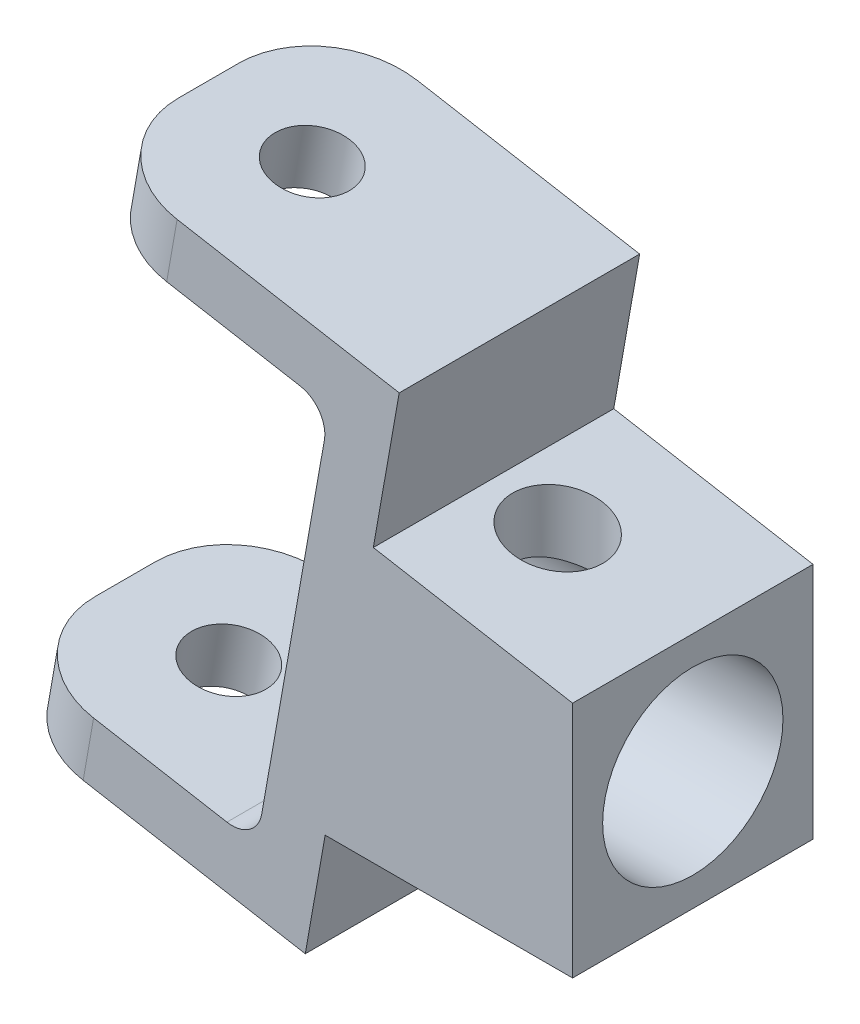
ISO-10303-21;
HEADER;
FILE_DESCRIPTION(('STEP AP214'),'2;1');
FILE_NAME('part.step','',(''),(''),'','','');
FILE_SCHEMA(('AUTOMOTIVE_DESIGN { 1 0 10303 214 1 1 1 1 }'));
ENDSEC;
DATA;
#1=APPLICATION_CONTEXT('core data for automotive mechanical design processes');
#2=APPLICATION_PROTOCOL_DEFINITION('international standard','automotive_design',2000,#1);
#3=PRODUCT_CONTEXT('',#1,'mechanical');
#4=PRODUCT('Part','Part','',(#3));
#5=PRODUCT_RELATED_PRODUCT_CATEGORY('part','',(#4));
#6=PRODUCT_DEFINITION_FORMATION('','',#4);
#7=PRODUCT_DEFINITION_CONTEXT('part definition',#1,'design');
#8=PRODUCT_DEFINITION('design','',#6,#7);
#9=PRODUCT_DEFINITION_SHAPE('','',#8);
#10=(LENGTH_UNIT() NAMED_UNIT(*) SI_UNIT(.MILLI.,.METRE.));
#11=(NAMED_UNIT(*) PLANE_ANGLE_UNIT() SI_UNIT($,.RADIAN.));
#12=(NAMED_UNIT(*) SI_UNIT($,.STERADIAN.) SOLID_ANGLE_UNIT());
#13=UNCERTAINTY_MEASURE_WITH_UNIT(LENGTH_MEASURE(1.E-05),#10,'distance_accuracy_value','');
#14=(GEOMETRIC_REPRESENTATION_CONTEXT(3) GLOBAL_UNCERTAINTY_ASSIGNED_CONTEXT((#13)) GLOBAL_UNIT_ASSIGNED_CONTEXT((#10,
#11,#12)) REPRESENTATION_CONTEXT('',''));
#15=CARTESIAN_POINT('',(0.,0.,0.));
#16=DIRECTION('',(0.,0.,1.));
#17=DIRECTION('',(1.,0.,0.));
#18=AXIS2_PLACEMENT_3D('',#15,#16,#17);
#19=CARTESIAN_POINT('',(-3.57647784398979,16.2849787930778,12.7));
#20=DIRECTION('',(-0.173648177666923,-0.984807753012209,0.));
#21=DIRECTION('',(0.98480775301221,-0.173648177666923,0.));
#22=AXIS2_PLACEMENT_3D('',#19,#20,#21);
#23=PLANE('',#22);
#24=DIRECTION('',(-0.984807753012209,0.173648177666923,0.));
#25=VECTOR('',#24,1.);
#26=CARTESIAN_POINT('',(-3.57647784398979,16.2849787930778,-12.7));
#27=LINE('',#26,#25);
#28=CARTESIAN_POINT('',(17.4752,12.573,-12.7));
#29=VERTEX_POINT('',#28);
#30=CARTESIAN_POINT('',(-3.57647784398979,16.2849787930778,-12.7));
#31=VERTEX_POINT('',#30);
#32=EDGE_CURVE('E228',#29,#31,#27,.T.);
#33=ORIENTED_EDGE('',*,*,#32,.T.);
#34=DIRECTION('',(0.,0.,-1.));
#35=VECTOR('',#34,1.);
#36=CARTESIAN_POINT('',(-3.57647784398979,16.2849787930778,12.7));
#37=LINE('',#36,#35);
#38=CARTESIAN_POINT('',(-3.57647784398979,16.2849787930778,12.7));
#39=VERTEX_POINT('',#38);
#40=EDGE_CURVE('E252',#39,#31,#37,.T.);
#41=ORIENTED_EDGE('',*,*,#40,.F.);
#42=DIRECTION('',(-0.984807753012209,0.173648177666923,0.));
#43=VECTOR('',#42,1.);
#44=CARTESIAN_POINT('',(-3.57647784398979,16.2849787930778,12.7));
#45=LINE('',#44,#43);
#46=CARTESIAN_POINT('',(17.4752,12.573,12.7));
#47=VERTEX_POINT('',#46);
#48=EDGE_CURVE('E206',#47,#39,#45,.T.);
#49=ORIENTED_EDGE('',*,*,#48,.F.);
#50=DIRECTION('',(0.,0.,-1.));
#51=VECTOR('',#50,1.);
#52=CARTESIAN_POINT('',(17.4752,12.573,12.7));
#53=LINE('',#52,#51);
#54=EDGE_CURVE('E255',#47,#29,#53,.T.);
#55=ORIENTED_EDGE('',*,*,#54,.T.);
#56=EDGE_LOOP('',(#33,#41,#49,#55));
#57=FACE_BOUND('',#56,.T.);
#58=CARTESIAN_POINT('',(3.2004,15.0900323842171,0.));
#59=DIRECTION('',(-0.173648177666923,-0.984807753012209,0.));
#60=DIRECTION('',(0.98480775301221,-0.173648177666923,0.));
#61=AXIS2_PLACEMENT_3D('',#58,#59,#60);
#62=ELLIPSE('',#61,4.83596923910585,4.7625);
#63=CARTESIAN_POINT('',(7.9629,14.2502751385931,0.));
#64=VERTEX_POINT('',#63);
#65=EDGE_CURVE('E328',#64,#64,#62,.F.);
#66=ORIENTED_EDGE('',*,*,#65,.F.);
#67=EDGE_LOOP('',(#66));
#68=FACE_BOUND('',#67,.T.);
#69=ADVANCED_FACE('F47',(#57,#68),#23,.F.);
#70=CARTESIAN_POINT('',(-23.495,0.,0.));
#71=DIRECTION('',(1.,0.,0.));
#72=DIRECTION('',(0.,0.,-1.));
#73=AXIS2_PLACEMENT_3D('',#70,#71,#72);
#74=CYLINDRICAL_SURFACE('',#73,9.525);
#75=CARTESIAN_POINT('',(3.2004,-8.98025612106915,3.175));
#76=CARTESIAN_POINT('',(3.02746354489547,-8.98025555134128,3.17500081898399));
#77=CARTESIAN_POINT('',(2.85453201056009,-8.98530617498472,3.16082293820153));
#78=CARTESIAN_POINT('',(2.51379221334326,-9.00485797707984,3.10467734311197));
#79=CARTESIAN_POINT('',(2.34598479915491,-9.01936071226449,3.06270505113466));
#80=CARTESIAN_POINT('',(2.02048461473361,-9.05599546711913,2.95260866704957));
#81=CARTESIAN_POINT('',(1.86277272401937,-9.07811252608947,2.8845358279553));
#82=CARTESIAN_POINT('',(1.56095684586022,-9.12746212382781,2.72434567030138));
#83=CARTESIAN_POINT('',(1.41685587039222,-9.15469579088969,2.63222304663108));
#84=CARTESIAN_POINT('',(1.14071411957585,-9.21240503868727,2.42268738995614));
#85=CARTESIAN_POINT('',(1.00928351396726,-9.24296141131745,2.30449228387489));
#86=CARTESIAN_POINT('',(0.76769340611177,-9.30319020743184,2.0478358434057));
#87=CARTESIAN_POINT('',(0.657537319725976,-9.33286248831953,1.90937126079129));
#88=CARTESIAN_POINT('',(0.458854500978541,-9.38891527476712,1.61164431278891));
#89=CARTESIAN_POINT('',(0.370967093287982,-9.41518969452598,1.45193356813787));
#90=CARTESIAN_POINT('',(0.223546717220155,-9.46053437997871,1.11896913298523));
#91=CARTESIAN_POINT('',(0.164006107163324,-9.47960658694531,0.945719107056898));
#92=CARTESIAN_POINT('',(0.0770386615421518,-9.50782564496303,0.596991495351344));
#93=CARTESIAN_POINT('',(0.0485665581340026,-9.5172947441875,0.421801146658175));
#94=CARTESIAN_POINT('',(0.0212207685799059,-9.52638456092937,0.0688907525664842));
#95=CARTESIAN_POINT('',(0.02233945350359,-9.52600781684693,-0.108828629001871));
#96=CARTESIAN_POINT('',(0.0534805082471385,-9.51566675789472,-0.454353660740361));
#97=CARTESIAN_POINT('',(0.0823675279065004,-9.50607905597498,-0.622274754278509));
#98=CARTESIAN_POINT('',(0.166347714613,-9.47886621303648,-0.950732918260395));
#99=CARTESIAN_POINT('',(0.221442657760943,-9.46124052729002,-1.11126948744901));
#100=CARTESIAN_POINT('',(0.356937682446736,-9.41945253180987,-1.42288410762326));
#101=CARTESIAN_POINT('',(0.437660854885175,-9.3952073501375,-1.57381010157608));
#102=CARTESIAN_POINT('',(0.621854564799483,-9.34270397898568,-1.86030973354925));
#103=CARTESIAN_POINT('',(0.725331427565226,-9.31444467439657,-1.99587908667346));
#104=CARTESIAN_POINT('',(0.957816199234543,-9.25532159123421,-2.2545702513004));
#105=CARTESIAN_POINT('',(1.0877967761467,-9.22439783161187,-2.37680549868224));
#106=CARTESIAN_POINT('',(1.36667470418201,-9.1645528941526,-2.5980302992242));
#107=CARTESIAN_POINT('',(1.51557496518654,-9.13563202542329,-2.6970162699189));
#108=CARTESIAN_POINT('',(1.83087526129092,-9.08273917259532,-2.87016016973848));
#109=CARTESIAN_POINT('',(1.99749451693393,-9.05884361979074,-2.94394402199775));
#110=CARTESIAN_POINT('',(2.34178917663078,-9.01959241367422,-3.06210713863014));
#111=CARTESIAN_POINT('',(2.51945991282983,-9.00423318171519,-3.10649872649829));
#112=CARTESIAN_POINT('',(2.87222677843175,-8.98460345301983,-3.16281207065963));
#113=CARTESIAN_POINT('',(3.04707742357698,-8.9798639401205,-3.17610837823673));
#114=CARTESIAN_POINT('',(3.39653927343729,-8.9806993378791,-3.17374726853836));
#115=CARTESIAN_POINT('',(3.57115051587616,-8.98627237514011,-3.15809511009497));
#116=CARTESIAN_POINT('',(3.90892336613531,-9.00663737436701,-3.09951644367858));
#117=CARTESIAN_POINT('',(4.07227224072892,-9.02110608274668,-3.05754530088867));
#118=CARTESIAN_POINT('',(4.38957594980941,-9.05727657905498,-2.94866651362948));
#119=CARTESIAN_POINT('',(4.54352911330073,-9.07897964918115,-2.88175444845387));
#120=CARTESIAN_POINT('',(4.84308283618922,-9.12802586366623,-2.72248103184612));
#121=CARTESIAN_POINT('',(4.98826359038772,-9.1555260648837,-2.62937980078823));
#122=CARTESIAN_POINT('',(5.26143871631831,-9.21276315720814,-2.42120937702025));
#123=CARTESIAN_POINT('',(5.38942800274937,-9.24250070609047,-2.30613370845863));
#124=CARTESIAN_POINT('',(5.63095134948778,-9.30259247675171,-2.05070616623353));
#125=CARTESIAN_POINT('',(5.74349368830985,-9.33290753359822,-1.90940458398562));
#126=CARTESIAN_POINT('',(5.94333375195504,-9.3893275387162,-1.60917665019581));
#127=CARTESIAN_POINT('',(6.0306323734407,-9.41543263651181,-1.45025092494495));
#128=CARTESIAN_POINT('',(6.17670883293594,-9.46036988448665,-1.12007606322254));
#129=CARTESIAN_POINT('',(6.23567230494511,-9.47924920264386,-0.948915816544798));
#130=CARTESIAN_POINT('',(6.32373558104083,-9.50781089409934,-0.598355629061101));
#131=CARTESIAN_POINT('',(6.35284616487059,-9.51749658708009,-0.418958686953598));
#132=CARTESIAN_POINT('',(6.37940709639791,-9.52632915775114,-0.0660886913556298));
#133=CARTESIAN_POINT('',(6.3782811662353,-9.52594996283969,0.107266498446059));
#134=CARTESIAN_POINT('',(6.34791304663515,-9.51586223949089,0.451202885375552));
#135=CARTESIAN_POINT('',(6.31867313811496,-9.50615446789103,0.621784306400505));
#136=CARTESIAN_POINT('',(6.23385140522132,-9.47867404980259,0.952633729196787));
#137=CARTESIAN_POINT('',(6.17869536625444,-9.46103195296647,1.11302251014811));
#138=CARTESIAN_POINT('',(6.04400133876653,-9.41949985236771,1.42233126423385));
#139=CARTESIAN_POINT('',(5.96445893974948,-9.39560871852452,1.57124915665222));
#140=CARTESIAN_POINT('',(5.77986679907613,-9.34294133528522,1.85938800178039));
#141=CARTESIAN_POINT('',(5.67398317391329,-9.31401720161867,1.9980473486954));
#142=CARTESIAN_POINT('',(5.44113278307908,-9.25490239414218,2.25609475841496));
#143=CARTESIAN_POINT('',(5.31415929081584,-9.22471131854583,2.37547664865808));
#144=CARTESIAN_POINT('',(5.03679029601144,-9.16505913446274,2.59633024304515));
#145=CARTESIAN_POINT('',(4.88567250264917,-9.13567286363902,2.69691791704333));
#146=CARTESIAN_POINT('',(4.56776319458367,-9.08241113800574,2.87119803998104));
#147=CARTESIAN_POINT('',(4.40097578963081,-9.05853424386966,2.94489751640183));
#148=CARTESIAN_POINT('',(4.06412120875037,-9.02021736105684,3.06020415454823));
#149=CARTESIAN_POINT('',(3.89454306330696,-9.00539959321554,3.10311136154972));
#150=CARTESIAN_POINT('',(3.55010703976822,-8.9854209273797,3.16050396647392));
#151=CARTESIAN_POINT('',(3.375251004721,-8.98025669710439,3.17499917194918));
#152=CARTESIAN_POINT('',(3.2004,-8.98025612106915,3.175));
#153=B_SPLINE_CURVE_WITH_KNOTS('',3,(#75,#76,#77,#78,#79,#80,#81,#82,#83,#84,#85,#86,#87,#88,
#89,#90,#91,#92,#93,#94,#95,#96,#97,#98,#99,#100,#101,#102,#103,#104,#105,#106,#107,#108,#109,
#110,#111,#112,#113,#114,#115,#116,#117,#118,#119,#120,#121,#122,#123,#124,#125,#126,#127,#128,
#129,#130,#131,#132,#133,#134,#135,#136,#137,#138,#139,#140,#141,#142,#143,#144,#145,#146,#147,
#148,#149,#150,#151,#152),.UNSPECIFIED.,.T.,.F.,(4,2,2,2,2,2,2,2,2,2,2,2,2,2,2,2,2,2,2,2,2,2,2,
2,2,2,2,2,2,2,2,2,2,2,2,2,2,2,4),(0.,0.518161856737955,1.03640907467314,1.55364379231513,
2.07099270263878,2.60671746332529,3.14252816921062,3.69231882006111,4.24196117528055,
4.77247962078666,5.30286129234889,5.81244090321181,6.32205505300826,6.83836754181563,
7.3548237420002,7.89559553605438,8.43645060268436,8.98501631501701,9.53335188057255,
10.056948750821,10.5804505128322,11.0859695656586,11.5915782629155,12.1132237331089,
12.6350231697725,13.1819271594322,13.7288117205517,14.2720628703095,14.815117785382,
15.3326491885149,15.8501386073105,16.3594083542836,16.8687702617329,17.3969527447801,
17.925304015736,18.4743376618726,19.023227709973,19.5473069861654,20.0712053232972),.UNSPECIFIED.);
#154=CARTESIAN_POINT('',(3.2004,-8.98025612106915,3.175));
#155=VERTEX_POINT('',#154);
#156=EDGE_CURVE('E329',#155,#155,#153,.T.);
#157=ORIENTED_EDGE('',*,*,#156,.T.);
#158=EDGE_LOOP('',(#157));
#159=FACE_BOUND('',#158,.T.);
#160=CARTESIAN_POINT('',(17.4752,0.,0.));
#161=DIRECTION('',(-1.,0.,0.));
#162=DIRECTION('',(0.,0.,1.));
#163=AXIS2_PLACEMENT_3D('',#160,#161,#162);
#164=CIRCLE('',#163,9.525);
#165=CARTESIAN_POINT('',(17.4752,0.,9.525));
#166=VERTEX_POINT('',#165);
#167=EDGE_CURVE('E222',#166,#166,#164,.T.);
#168=ORIENTED_EDGE('',*,*,#167,.F.);
#169=EDGE_LOOP('',(#168));
#170=FACE_BOUND('',#169,.T.);
#171=CARTESIAN_POINT('',(-12.8959179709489,0.,0.));
#172=DIRECTION('',(0.984807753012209,-0.173648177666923,0.));
#173=DIRECTION('',(0.173648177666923,0.984807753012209,0.));
#174=AXIS2_PLACEMENT_3D('',#171,#172,#173);
#175=ELLIPSE('',#174,9.67193847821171,9.525);
#176=CARTESIAN_POINT('',(-11.2164034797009,9.525,0.));
#177=VERTEX_POINT('',#176);
#178=EDGE_CURVE('E265',#177,#177,#175,.T.);
#179=ORIENTED_EDGE('',*,*,#178,.F.);
#180=EDGE_LOOP('',(#179));
#181=FACE_BOUND('',#180,.T.);
#182=CARTESIAN_POINT('',(3.2004,8.24889197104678,-4.7625));
#183=CARTESIAN_POINT('',(3.32454090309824,8.24889272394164,-4.76249940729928));
#184=CARTESIAN_POINT('',(3.44869285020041,8.25170408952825,-4.75763943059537));
#185=CARTESIAN_POINT('',(3.69603834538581,8.26284430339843,-4.73826449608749));
#186=CARTESIAN_POINT('',(3.8192314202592,8.27117572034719,-4.72374504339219));
#187=CARTESIAN_POINT('',(4.06385414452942,8.29306424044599,-4.68521103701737));
#188=CARTESIAN_POINT('',(4.18528071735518,8.30662953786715,-4.66118159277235));
#189=CARTESIAN_POINT('',(4.42533163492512,8.33849424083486,-4.60393332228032));
#190=CARTESIAN_POINT('',(4.54395473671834,8.35679570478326,-4.57071050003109));
#191=CARTESIAN_POINT('',(4.89309842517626,8.41767757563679,-4.45820926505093));
#192=CARTESIAN_POINT('',(5.11848003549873,8.46639036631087,-4.36584227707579));
#193=CARTESIAN_POINT('',(5.55037176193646,8.57453511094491,-4.14940045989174));
#194=CARTESIAN_POINT('',(5.75688085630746,8.63396764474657,-4.02532391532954));
#195=CARTESIAN_POINT('',(6.16411386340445,8.76284791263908,-3.73698658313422));
#196=CARTESIAN_POINT('',(6.36295582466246,8.83271738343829,-3.57025552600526));
#197=CARTESIAN_POINT('',(6.73138327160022,8.97122433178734,-3.20633353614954));
#198=CARTESIAN_POINT('',(6.9009541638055,9.03986117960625,-3.00912750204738));
#199=CARTESIAN_POINT('',(7.1353931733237,9.13908932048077,-2.68636629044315));
#200=CARTESIAN_POINT('',(7.21224727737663,9.17251360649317,-2.57020878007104));
#201=CARTESIAN_POINT('',(7.35580380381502,9.23620349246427,-2.33097830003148));
#202=CARTESIAN_POINT('',(7.42251026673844,9.26647034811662,-2.20790810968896));
#203=CARTESIAN_POINT('',(7.54511086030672,9.32297018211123,-1.95564815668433));
#204=CARTESIAN_POINT('',(7.60100777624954,9.34920419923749,-1.8264599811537));
#205=CARTESIAN_POINT('',(7.70137304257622,9.39686248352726,-1.56285911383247));
#206=CARTESIAN_POINT('',(7.7458426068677,9.41828726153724,-1.42844697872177));
#207=CARTESIAN_POINT('',(7.82003977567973,9.45432792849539,-1.16519740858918));
#208=CARTESIAN_POINT('',(7.85059082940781,9.46931966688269,-1.03664325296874));
#209=CARTESIAN_POINT('',(7.90095552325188,9.49415396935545,-0.776963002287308));
#210=CARTESIAN_POINT('',(7.9207702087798,9.50399703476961,-0.645837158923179));
#211=CARTESIAN_POINT('',(7.94939346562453,9.51824582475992,-0.382159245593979));
#212=CARTESIAN_POINT('',(7.95820734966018,9.52265417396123,-0.249607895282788));
#213=CARTESIAN_POINT('',(7.9647234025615,9.52591136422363,0.0158324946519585));
#214=CARTESIAN_POINT('',(7.96242625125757,9.52476054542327,0.148721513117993));
#215=CARTESIAN_POINT('',(7.94744035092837,9.51727773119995,0.402105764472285));
#216=CARTESIAN_POINT('',(7.93567586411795,9.51140660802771,0.522670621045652));
#217=CARTESIAN_POINT('',(7.90305197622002,9.49520689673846,0.762297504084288));
#218=CARTESIAN_POINT('',(7.88218970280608,9.48487690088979,0.881359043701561));
#219=CARTESIAN_POINT('',(7.8316014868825,9.4600084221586,1.11709538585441));
#220=CARTESIAN_POINT('',(7.80187851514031,9.44547134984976,1.23377097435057));
#221=CARTESIAN_POINT('',(7.73387365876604,9.41253030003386,1.46405663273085));
#222=CARTESIAN_POINT('',(7.69558848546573,9.39412483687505,1.57766550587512));
#223=CARTESIAN_POINT('',(7.5672557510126,9.33315909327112,1.91586173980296));
#224=CARTESIAN_POINT('',(7.46439106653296,9.28518547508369,2.13476891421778));
#225=CARTESIAN_POINT('',(7.22820846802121,9.1791264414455,2.55262754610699));
#226=CARTESIAN_POINT('',(7.09487965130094,9.12103740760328,2.75157182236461));
#227=CARTESIAN_POINT('',(6.7870735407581,8.99371794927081,3.14406030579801));
#228=CARTESIAN_POINT('',(6.60989793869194,8.92395340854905,3.33531640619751));
#229=CARTESIAN_POINT('',(6.22650279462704,8.78462733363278,3.68669670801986));
#230=CARTESIAN_POINT('',(6.02026111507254,8.71506599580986,3.84679695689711));
#231=CARTESIAN_POINT('',(5.68528647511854,8.61432292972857,4.06522723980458));
#232=CARTESIAN_POINT('',(5.56540552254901,8.58040455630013,4.13613898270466));
#233=CARTESIAN_POINT('',(5.31921939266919,8.51583950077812,4.2674875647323));
#234=CARTESIAN_POINT('',(5.19291713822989,8.48519134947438,4.32792911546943));
#235=CARTESIAN_POINT('',(4.93467749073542,8.42829064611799,4.43772127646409));
#236=CARTESIAN_POINT('',(4.80274209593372,8.40203655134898,4.48707578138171));
#237=CARTESIAN_POINT('',(4.53419461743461,8.35498507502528,4.57409004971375));
#238=CARTESIAN_POINT('',(4.39758547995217,8.33418432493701,4.61175703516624));
#239=CARTESIAN_POINT('',(4.13167489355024,8.30033105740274,4.67239107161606));
#240=CARTESIAN_POINT('',(4.00264530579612,8.28679731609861,4.69628224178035));
#241=CARTESIAN_POINT('',(3.74263279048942,8.26567972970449,4.73335209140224));
#242=CARTESIAN_POINT('',(3.61165091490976,8.25809279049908,4.74653634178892));
#243=CARTESIAN_POINT('',(3.3488800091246,8.24918359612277,4.76200330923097));
#244=CARTESIAN_POINT('',(3.21709129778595,8.24785900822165,4.76429008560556));
#245=CARTESIAN_POINT('',(2.95387308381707,8.25152581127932,4.75793657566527));
#246=CARTESIAN_POINT('',(2.82244355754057,8.25651677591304,4.74929702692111));
#247=CARTESIAN_POINT('',(2.57547646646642,8.27171481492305,4.72277057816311));
#248=CARTESIAN_POINT('',(2.45977794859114,8.28128924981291,4.70600273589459));
#249=CARTESIAN_POINT('',(2.23035796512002,8.30494741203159,4.66412284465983));
#250=CARTESIAN_POINT('',(2.1166371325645,8.3190325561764,4.63900817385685));
#251=CARTESIAN_POINT('',(1.77954618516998,8.36742301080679,4.55152408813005));
#252=CARTESIAN_POINT('',(1.5600861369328,8.40787423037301,4.47699683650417));
#253=CARTESIAN_POINT('',(1.12671869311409,8.50278882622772,4.29409140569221));
#254=CARTESIAN_POINT('',(0.913539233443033,8.55781440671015,4.18430528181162));
#255=CARTESIAN_POINT('',(0.507360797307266,8.67518529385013,3.93519108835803));
#256=CARTESIAN_POINT('',(0.314372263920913,8.73753435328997,3.79584784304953));
#257=CARTESIAN_POINT('',(-0.0713340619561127,8.87196405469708,3.4710976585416));
#258=CARTESIAN_POINT('',(-0.260951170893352,8.94428069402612,3.28209830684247));
#259=CARTESIAN_POINT('',(-0.60682104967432,9.08372577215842,2.87366994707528));
#260=CARTESIAN_POINT('',(-0.763062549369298,9.15085245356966,2.65423070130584));
#261=CARTESIAN_POINT('',(-0.970606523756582,9.24324496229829,2.30289806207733));
#262=CARTESIAN_POINT('',(-1.03599815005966,9.27299632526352,2.18030840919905));
#263=CARTESIAN_POINT('',(-1.15610308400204,9.32847745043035,1.9291530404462));
#264=CARTESIAN_POINT('',(-1.21082112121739,9.35420899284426,1.80059000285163));
#265=CARTESIAN_POINT('',(-1.30894255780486,9.40087915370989,1.53844708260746));
#266=CARTESIAN_POINT('',(-1.35235135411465,9.42182005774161,1.40486962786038));
#267=CARTESIAN_POINT('',(-1.42732989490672,9.45827821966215,1.13371049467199));
#268=CARTESIAN_POINT('',(-1.4589010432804,9.47379612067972,0.996129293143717));
#269=CARTESIAN_POINT('',(-1.50742176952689,9.49775785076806,0.730949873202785));
#270=CARTESIAN_POINT('',(-1.52544742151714,9.50672024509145,0.603594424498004));
#271=CARTESIAN_POINT('',(-1.55114001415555,9.51951815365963,0.34759030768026));
#272=CARTESIAN_POINT('',(-1.55880775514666,9.52335406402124,0.218941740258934));
#273=CARTESIAN_POINT('',(-1.56368417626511,9.52579195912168,-0.0385649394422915));
#274=CARTESIAN_POINT('',(-1.56089590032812,9.52439546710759,-0.167422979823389));
#275=CARTESIAN_POINT('',(-1.54490494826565,9.51641162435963,-0.424324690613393));
#276=CARTESIAN_POINT('',(-1.5317025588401,9.50982441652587,-0.552368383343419));
#277=CARTESIAN_POINT('',(-1.49626541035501,9.4922422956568,-0.798199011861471));
#278=CARTESIAN_POINT('',(-1.47468637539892,9.48156800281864,-0.916103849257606));
#279=CARTESIAN_POINT('',(-1.42283196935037,9.45610870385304,-1.14954398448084));
#280=CARTESIAN_POINT('',(-1.39255382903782,9.44132238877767,-1.26507851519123));
#281=CARTESIAN_POINT('',(-1.28910564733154,9.39128133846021,-1.60695881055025));
#282=CARTESIAN_POINT('',(-1.20329141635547,9.35032881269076,-1.82878870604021));
#283=CARTESIAN_POINT('',(-0.996655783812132,9.25477034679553,-2.26424000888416));
#284=CARTESIAN_POINT('',(-0.874494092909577,9.1996553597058,-2.47710454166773));
#285=CARTESIAN_POINT('',(-0.600274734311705,9.08152237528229,-2.88023067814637));
#286=CARTESIAN_POINT('',(-0.448203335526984,9.01850075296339,-3.07048183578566));
#287=CARTESIAN_POINT('',(-0.100988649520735,8.88342722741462,-3.44287591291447));
#288=CARTESIAN_POINT('',(0.0969350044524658,8.81110081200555,-3.62232759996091));
#289=CARTESIAN_POINT('',(0.52130043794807,8.67074486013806,-3.94652779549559));
#290=CARTESIAN_POINT('',(0.747767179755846,8.60271916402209,-4.09124560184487));
#291=CARTESIAN_POINT('',(1.10891923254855,8.50907579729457,-4.28094082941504));
#292=CARTESIAN_POINT('',(1.23503657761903,8.47885685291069,-4.34031088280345));
#293=CARTESIAN_POINT('',(1.49281082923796,8.42284293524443,-4.44803619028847));
#294=CARTESIAN_POINT('',(1.62446484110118,8.39704568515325,-4.49639711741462));
#295=CARTESIAN_POINT('',(1.89205350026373,8.35096779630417,-4.58140792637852));
#296=CARTESIAN_POINT('',(2.02797612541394,8.33067298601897,-4.61808793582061));
#297=CARTESIAN_POINT('',(2.3032327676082,8.29641582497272,-4.67935352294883));
#298=CARTESIAN_POINT('',(2.44256432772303,8.28244904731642,-4.70394755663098));
#299=CARTESIAN_POINT('',(2.6850954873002,8.26434282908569,-4.73566148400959));
#300=CARTESIAN_POINT('',(2.78780006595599,8.25856285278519,-4.74571628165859));
#301=CARTESIAN_POINT('',(2.99380052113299,8.25083698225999,-4.7591360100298));
#302=CARTESIAN_POINT('',(3.09709643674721,8.24889134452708,-4.76250049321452));
#303=CARTESIAN_POINT('',(3.2004,8.24889197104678,-4.7625));
#304=B_SPLINE_CURVE_WITH_KNOTS('',3,(#182,#183,#184,#185,#186,#187,#188,#189,#190,#191,#192,
#193,#194,#195,#196,#197,#198,#199,#200,#201,#202,#203,#204,#205,#206,#207,#208,#209,#210,#211,
#212,#213,#214,#215,#216,#217,#218,#219,#220,#221,#222,#223,#224,#225,#226,#227,#228,#229,#230,
#231,#232,#233,#234,#235,#236,#237,#238,#239,#240,#241,#242,#243,#244,#245,#246,#247,#248,#249,
#250,#251,#252,#253,#254,#255,#256,#257,#258,#259,#260,#261,#262,#263,#264,#265,#266,#267,#268,
#269,#270,#271,#272,#273,#274,#275,#276,#277,#278,#279,#280,#281,#282,#283,#284,#285,#286,#287,
#288,#289,#290,#291,#292,#293,#294,#295,#296,#297,#298,#299,#300,#301,#302,#303),.UNSPECIFIED.,
.T.,.F.,(4,2,2,2,2,2,2,2,2,2,2,2,2,2,2,2,2,2,2,2,2,2,2,2,2,2,2,2,2,2,2,2,2,2,2,2,2,2,2,2,2,2,2,
2,2,2,2,2,2,2,2,2,2,2,2,2,2,2,2,2,4),(0.,0.372315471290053,0.744804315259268,1.11787871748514,
1.49111553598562,2.23280682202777,2.97453823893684,3.77744614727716,4.58075320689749,
5.00998800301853,5.43905143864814,5.8680041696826,6.29691131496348,6.69531812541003,
7.09368613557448,7.4918616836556,7.89001286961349,8.25342137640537,8.61694470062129,
8.98034628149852,9.3438876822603,10.0802760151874,10.8169283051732,11.6232144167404,
12.4301179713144,12.8597106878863,13.2891095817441,13.7183573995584,14.1473394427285,
14.5425345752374,14.9375239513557,15.3323661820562,15.7271817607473,16.0786628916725,
16.4302545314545,17.1329551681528,17.8682015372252,18.603826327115,19.432180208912,
20.2608133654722,20.6865967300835,21.1121909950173,21.5375817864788,21.9629221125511,
22.3492223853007,22.735492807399,23.1216507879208,23.5077981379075,23.8683853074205,
24.2290873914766,24.9498683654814,25.7014774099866,26.4534323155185,27.2802219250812,
28.1077396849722,28.5351353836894,28.9623103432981,29.388374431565,29.8141399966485,
30.1239407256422,30.4337621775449),.UNSPECIFIED.);
#305=CARTESIAN_POINT('',(3.2004,8.24889197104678,-4.7625));
#306=VERTEX_POINT('',#305);
#307=EDGE_CURVE('E322',#306,#306,#304,.T.);
#308=ORIENTED_EDGE('',*,*,#307,.F.);
#309=EDGE_LOOP('',(#308));
#310=FACE_BOUND('',#309,.T.);
#311=ADVANCED_FACE('F330',(#159,#170,#181,#310),#74,.F.);
#312=CARTESIAN_POINT('',(-42.5048376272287,-12.4325729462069,12.7));
#313=DIRECTION('',(0.984807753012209,-0.173648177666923,0.));
#314=DIRECTION('',(0.173648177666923,0.984807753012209,0.));
#315=AXIS2_PLACEMENT_3D('',#312,#313,#314);
#316=PLANE('',#315);
#317=DIRECTION('',(0.,0.,-1.));
#318=VECTOR('',#317,1.);
#319=CARTESIAN_POINT('',(-43.6075035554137,-18.6861021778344,12.7));
#320=LINE('',#319,#318);
#321=CARTESIAN_POINT('',(-43.6075035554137,-18.6861021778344,3.175));
#322=VERTEX_POINT('',#321);
#323=CARTESIAN_POINT('',(-43.6075035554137,-18.6861021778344,-3.175));
#324=VERTEX_POINT('',#323);
#325=EDGE_CURVE('E193',#322,#324,#320,.T.);
#326=ORIENTED_EDGE('',*,*,#325,.F.);
#327=DIRECTION('',(-0.173648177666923,-0.984807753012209,0.));
#328=VECTOR('',#327,1.);
#329=CARTESIAN_POINT('',(-42.5048376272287,-12.4325729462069,3.175));
#330=LINE('',#329,#328);
#331=CARTESIAN_POINT('',(-42.5048376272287,-12.4325729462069,3.175));
#332=VERTEX_POINT('',#331);
#333=EDGE_CURVE('E284',#322,#332,#330,.F.);
#334=ORIENTED_EDGE('',*,*,#333,.T.);
#335=DIRECTION('',(0.,0.,-1.));
#336=VECTOR('',#335,1.);
#337=CARTESIAN_POINT('',(-42.5048376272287,-12.4325729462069,12.7));
#338=LINE('',#337,#336);
#339=CARTESIAN_POINT('',(-42.5048376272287,-12.4325729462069,-3.175));
#340=VERTEX_POINT('',#339);
#341=EDGE_CURVE('E219',#332,#340,#338,.T.);
#342=ORIENTED_EDGE('',*,*,#341,.T.);
#343=DIRECTION('',(-0.173648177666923,-0.984807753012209,0.));
#344=VECTOR('',#343,1.);
#345=CARTESIAN_POINT('',(-42.5048376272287,-12.4325729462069,-3.175));
#346=LINE('',#345,#344);
#347=EDGE_CURVE('E281',#340,#324,#346,.T.);
#348=ORIENTED_EDGE('',*,*,#347,.T.);
#349=EDGE_LOOP('',(#326,#334,#342,#348));
#350=FACE_BOUND('',#349,.T.);
#351=ADVANCED_FACE('F361',(#350),#316,.F.);
#352=CARTESIAN_POINT('',(-43.6075035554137,-18.6861021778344,12.7));
#353=DIRECTION('',(0.173648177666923,0.984807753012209,0.));
#354=DIRECTION('',(-0.98480775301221,0.173648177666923,0.));
#355=AXIS2_PLACEMENT_3D('',#352,#353,#354);
#356=PLANE('',#355);
#357=CARTESIAN_POINT('',(-32.6513203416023,-20.6179728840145,0.));
#358=DIRECTION('',(0.173648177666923,0.984807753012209,0.));
#359=DIRECTION('',(-0.98480775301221,0.173648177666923,0.));
#360=AXIS2_PLACEMENT_3D('',#357,#358,#359);
#361=CIRCLE('',#360,3.9878);
#362=CARTESIAN_POINT('',(-36.5785366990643,-19.9254986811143,0.));
#363=VERTEX_POINT('',#362);
#364=EDGE_CURVE('E268',#363,#363,#361,.T.);
#365=ORIENTED_EDGE('',*,*,#364,.T.);
#366=EDGE_LOOP('',(#365));
#367=FACE_BOUND('',#366,.T.);
#368=DIRECTION('',(0.984807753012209,-0.173648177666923,0.));
#369=VECTOR('',#368,1.);
#370=CARTESIAN_POINT('',(-43.6075035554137,-18.6861021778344,12.7));
#371=LINE('',#370,#369);
#372=CARTESIAN_POINT('',(-34.2272097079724,-20.3401010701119,12.7));
#373=VERTEX_POINT('',#372);
#374=CARTESIAN_POINT('',(-10.7639680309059,-24.4773036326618,12.7));
#375=VERTEX_POINT('',#374);
#376=EDGE_CURVE('E174',#373,#375,#371,.T.);
#377=ORIENTED_EDGE('',*,*,#376,.F.);
#378=CARTESIAN_POINT('',(-34.2272097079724,-20.3401010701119,3.175));
#379=DIRECTION('',(0.173648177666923,0.984807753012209,0.));
#380=DIRECTION('',(-0.98480775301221,0.173648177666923,0.));
#381=AXIS2_PLACEMENT_3D('',#378,#379,#380);
#382=CIRCLE('',#381,9.525);
#383=EDGE_CURVE('E279',#373,#322,#382,.F.);
#384=ORIENTED_EDGE('',*,*,#383,.T.);
#385=ORIENTED_EDGE('',*,*,#325,.T.);
#386=CARTESIAN_POINT('',(-34.2272097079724,-20.3401010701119,-3.175));
#387=DIRECTION('',(0.173648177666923,0.984807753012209,0.));
#388=DIRECTION('',(-0.98480775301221,0.173648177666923,0.));
#389=AXIS2_PLACEMENT_3D('',#386,#387,#388);
#390=CIRCLE('',#389,9.525);
#391=CARTESIAN_POINT('',(-34.2272097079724,-20.3401010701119,-12.7));
#392=VERTEX_POINT('',#391);
#393=EDGE_CURVE('E277',#324,#392,#390,.F.);
#394=ORIENTED_EDGE('',*,*,#393,.T.);
#395=DIRECTION('',(0.984807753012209,-0.173648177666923,0.));
#396=VECTOR('',#395,1.);
#397=CARTESIAN_POINT('',(-43.6075035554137,-18.6861021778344,-12.7));
#398=LINE('',#397,#396);
#399=CARTESIAN_POINT('',(-10.7639680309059,-24.4773036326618,-12.7));
#400=VERTEX_POINT('',#399);
#401=EDGE_CURVE('E190',#392,#400,#398,.T.);
#402=ORIENTED_EDGE('',*,*,#401,.T.);
#403=DIRECTION('',(0.,0.,-1.));
#404=VECTOR('',#403,1.);
#405=CARTESIAN_POINT('',(-10.7639680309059,-24.4773036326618,12.7));
#406=LINE('',#405,#404);
#407=EDGE_CURVE('E187',#375,#400,#406,.T.);
#408=ORIENTED_EDGE('',*,*,#407,.F.);
#409=EDGE_LOOP('',(#377,#384,#385,#394,#402,#408));
#410=FACE_BOUND('',#409,.T.);
#411=ADVANCED_FACE('F188',(#367,#410),#356,.F.);
#412=CARTESIAN_POINT('',(-10.7639680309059,-24.4773036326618,12.7));
#413=DIRECTION('',(-0.984807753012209,0.173648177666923,0.));
#414=DIRECTION('',(-0.173648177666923,-0.98480775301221,0.));
#415=AXIS2_PLACEMENT_3D('',#412,#413,#414);
#416=PLANE('',#415);
#417=DIRECTION('',(0.173648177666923,0.984807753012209,0.));
#418=VECTOR('',#417,1.);
#419=CARTESIAN_POINT('',(-10.7639680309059,-24.4773036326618,-12.7));
#420=LINE('',#419,#418);
#421=CARTESIAN_POINT('',(-8.66491811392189,-12.573,-12.7));
#422=VERTEX_POINT('',#421);
#423=EDGE_CURVE('E221',#400,#422,#420,.T.);
#424=ORIENTED_EDGE('',*,*,#423,.T.);
#425=DIRECTION('',(0.,0.,-1.));
#426=VECTOR('',#425,1.);
#427=CARTESIAN_POINT('',(-8.66491811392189,-12.573,12.7));
#428=LINE('',#427,#426);
#429=CARTESIAN_POINT('',(-8.66491811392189,-12.573,12.7));
#430=VERTEX_POINT('',#429);
#431=EDGE_CURVE('E194',#430,#422,#428,.T.);
#432=ORIENTED_EDGE('',*,*,#431,.F.);
#433=DIRECTION('',(0.173648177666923,0.984807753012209,0.));
#434=VECTOR('',#433,1.);
#435=CARTESIAN_POINT('',(-10.7639680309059,-24.4773036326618,12.7));
#436=LINE('',#435,#434);
#437=EDGE_CURVE('E179',#375,#430,#436,.T.);
#438=ORIENTED_EDGE('',*,*,#437,.F.);
#439=ORIENTED_EDGE('',*,*,#407,.T.);
#440=EDGE_LOOP('',(#424,#432,#438,#439));
#441=FACE_BOUND('',#440,.T.);
#442=ADVANCED_FACE('F196',(#441),#416,.F.);
#443=CARTESIAN_POINT('',(-8.66491811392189,-12.573,12.7));
#444=DIRECTION('',(0.,1.,0.));
#445=DIRECTION('',(0.,0.,1.));
#446=AXIS2_PLACEMENT_3D('',#443,#444,#445);
#447=PLANE('',#446);
#448=CARTESIAN_POINT('',(3.2004,-12.573,0.));
#449=DIRECTION('',(0.,1.,0.));
#450=DIRECTION('',(0.,0.,1.));
#451=AXIS2_PLACEMENT_3D('',#448,#449,#450);
#452=CIRCLE('',#451,3.175);
#453=CARTESIAN_POINT('',(3.2004,-12.573,3.175));
#454=VERTEX_POINT('',#453);
#455=EDGE_CURVE('E51',#454,#454,#452,.T.);
#456=ORIENTED_EDGE('',*,*,#455,.T.);
#457=EDGE_LOOP('',(#456));
#458=FACE_BOUND('',#457,.T.);
#459=DIRECTION('',(1.,0.,0.));
#460=VECTOR('',#459,1.);
#461=CARTESIAN_POINT('',(-8.66491811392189,-12.573,-12.7));
#462=LINE('',#461,#460);
#463=CARTESIAN_POINT('',(17.4752,-12.573,-12.7));
#464=VERTEX_POINT('',#463);
#465=EDGE_CURVE('E224',#422,#464,#462,.T.);
#466=ORIENTED_EDGE('',*,*,#465,.T.);
#467=DIRECTION('',(0.,0.,-1.));
#468=VECTOR('',#467,1.);
#469=CARTESIAN_POINT('',(17.4752,-12.573,12.7));
#470=LINE('',#469,#468);
#471=CARTESIAN_POINT('',(17.4752,-12.573,12.7));
#472=VERTEX_POINT('',#471);
#473=EDGE_CURVE('E258',#472,#464,#470,.T.);
#474=ORIENTED_EDGE('',*,*,#473,.F.);
#475=DIRECTION('',(1.,0.,0.));
#476=VECTOR('',#475,1.);
#477=CARTESIAN_POINT('',(-8.66491811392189,-12.573,12.7));
#478=LINE('',#477,#476);
#479=EDGE_CURVE('E199',#430,#472,#478,.T.);
#480=ORIENTED_EDGE('',*,*,#479,.F.);
#481=ORIENTED_EDGE('',*,*,#431,.T.);
#482=EDGE_LOOP('',(#466,#474,#480,#481));
#483=FACE_BOUND('',#482,.T.);
#484=ADVANCED_FACE('F371',(#458,#483),#447,.F.);
#485=CARTESIAN_POINT('',(17.4752,-12.573,12.7));
#486=DIRECTION('',(-1.,0.,0.));
#487=DIRECTION('',(0.,0.,1.));
#488=AXIS2_PLACEMENT_3D('',#485,#486,#487);
#489=PLANE('',#488);
#490=ORIENTED_EDGE('',*,*,#167,.T.);
#491=EDGE_LOOP('',(#490));
#492=FACE_BOUND('',#491,.T.);
#493=DIRECTION('',(0.,1.,0.));
#494=VECTOR('',#493,1.);
#495=CARTESIAN_POINT('',(17.4752,-12.573,-12.7));
#496=LINE('',#495,#494);
#497=EDGE_CURVE('E226',#464,#29,#496,.T.);
#498=ORIENTED_EDGE('',*,*,#497,.T.);
#499=ORIENTED_EDGE('',*,*,#54,.F.);
#500=DIRECTION('',(0.,1.,0.));
#501=VECTOR('',#500,1.);
#502=CARTESIAN_POINT('',(17.4752,-12.573,12.7));
#503=LINE('',#502,#501);
#504=EDGE_CURVE('E201',#472,#47,#503,.T.);
#505=ORIENTED_EDGE('',*,*,#504,.F.);
#506=ORIENTED_EDGE('',*,*,#473,.T.);
#507=EDGE_LOOP('',(#498,#499,#505,#506));
#508=FACE_BOUND('',#507,.T.);
#509=ADVANCED_FACE('F368',(#492,#508),#489,.F.);
#510=CARTESIAN_POINT('',(-0.839974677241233,31.8044594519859,12.7));
#511=DIRECTION('',(-0.984807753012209,0.173648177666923,0.));
#512=DIRECTION('',(-0.173648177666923,-0.98480775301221,0.));
#513=AXIS2_PLACEMENT_3D('',#510,#511,#512);
#514=PLANE('',#513);
#515=DIRECTION('',(0.173648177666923,0.984807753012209,0.));
#516=VECTOR('',#515,1.);
#517=CARTESIAN_POINT('',(-0.839974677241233,31.8044594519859,-12.7));
#518=LINE('',#517,#516);
#519=CARTESIAN_POINT('',(-0.839974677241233,31.8044594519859,-12.7));
#520=VERTEX_POINT('',#519);
#521=EDGE_CURVE('E230',#31,#520,#518,.T.);
#522=ORIENTED_EDGE('',*,*,#521,.T.);
#523=DIRECTION('',(0.,0.,-1.));
#524=VECTOR('',#523,1.);
#525=CARTESIAN_POINT('',(-0.839974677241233,31.8044594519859,12.7));
#526=LINE('',#525,#524);
#527=CARTESIAN_POINT('',(-0.839974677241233,31.8044594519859,12.7));
#528=VERTEX_POINT('',#527);
#529=EDGE_CURVE('E249',#528,#520,#526,.T.);
#530=ORIENTED_EDGE('',*,*,#529,.F.);
#531=DIRECTION('',(0.173648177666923,0.984807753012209,0.));
#532=VECTOR('',#531,1.);
#533=CARTESIAN_POINT('',(-0.839974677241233,31.8044594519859,12.7));
#534=LINE('',#533,#532);
#535=EDGE_CURVE('E208',#39,#528,#534,.T.);
#536=ORIENTED_EDGE('',*,*,#535,.F.);
#537=ORIENTED_EDGE('',*,*,#40,.T.);
#538=EDGE_LOOP('',(#522,#530,#536,#537));
#539=FACE_BOUND('',#538,.T.);
#540=ADVANCED_FACE('F366',(#539),#514,.F.);
#541=CARTESIAN_POINT('',(-0.839974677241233,31.8044594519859,12.7));
#542=DIRECTION('',(-0.173648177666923,-0.984807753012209,0.));
#543=DIRECTION('',(0.984807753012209,-0.173648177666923,0.));
#544=AXIS2_PLACEMENT_3D('',#541,#542,#543);
#545=PLANE('',#544);
#546=CARTESIAN_POINT('',(-22.7273269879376,35.6637902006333,0.));
#547=DIRECTION('',(0.173648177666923,0.984807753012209,0.));
#548=DIRECTION('',(-0.984807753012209,0.173648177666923,0.));
#549=AXIS2_PLACEMENT_3D('',#546,#547,#548);
#550=CIRCLE('',#549,3.9878);
#551=CARTESIAN_POINT('',(-26.6545433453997,36.3562644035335,0.));
#552=VERTEX_POINT('',#551);
#553=EDGE_CURVE('E273',#552,#552,#550,.T.);
#554=ORIENTED_EDGE('',*,*,#553,.F.);
#555=EDGE_LOOP('',(#554));
#556=FACE_BOUND('',#555,.T.);
#557=DIRECTION('',(-0.984807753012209,0.173648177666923,0.));
#558=VECTOR('',#557,1.);
#559=CARTESIAN_POINT('',(-0.839974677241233,31.8044594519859,-12.7));
#560=LINE('',#559,#558);
#561=CARTESIAN_POINT('',(-24.3032163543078,35.9416620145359,-12.7));
#562=VERTEX_POINT('',#561);
#563=EDGE_CURVE('E232',#520,#562,#560,.T.);
#564=ORIENTED_EDGE('',*,*,#563,.T.);
#565=CARTESIAN_POINT('',(-24.3032163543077,35.9416620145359,-3.175));
#566=DIRECTION('',(-0.173648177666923,-0.984807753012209,0.));
#567=DIRECTION('',(0.984807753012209,-0.173648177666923,0.));
#568=AXIS2_PLACEMENT_3D('',#565,#566,#567);
#569=CIRCLE('',#568,9.525);
#570=CARTESIAN_POINT('',(-33.683510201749,37.5956609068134,-3.175));
#571=VERTEX_POINT('',#570);
#572=EDGE_CURVE('E307',#562,#571,#569,.F.);
#573=ORIENTED_EDGE('',*,*,#572,.T.);
#574=DIRECTION('',(0.,0.,-1.));
#575=VECTOR('',#574,1.);
#576=CARTESIAN_POINT('',(-33.683510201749,37.5956609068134,12.7));
#577=LINE('',#576,#575);
#578=CARTESIAN_POINT('',(-33.683510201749,37.5956609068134,3.175));
#579=VERTEX_POINT('',#578);
#580=EDGE_CURVE('E246',#579,#571,#577,.T.);
#581=ORIENTED_EDGE('',*,*,#580,.F.);
#582=CARTESIAN_POINT('',(-24.3032163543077,35.9416620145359,3.175));
#583=DIRECTION('',(-0.173648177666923,-0.984807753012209,0.));
#584=DIRECTION('',(0.984807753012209,-0.173648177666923,0.));
#585=AXIS2_PLACEMENT_3D('',#582,#583,#584);
#586=CIRCLE('',#585,9.525);
#587=CARTESIAN_POINT('',(-24.3032163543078,35.9416620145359,12.7));
#588=VERTEX_POINT('',#587);
#589=EDGE_CURVE('E305',#579,#588,#586,.F.);
#590=ORIENTED_EDGE('',*,*,#589,.T.);
#591=DIRECTION('',(-0.984807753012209,0.173648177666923,0.));
#592=VECTOR('',#591,1.);
#593=CARTESIAN_POINT('',(-0.839974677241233,31.8044594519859,12.7));
#594=LINE('',#593,#592);
#595=EDGE_CURVE('E210',#528,#588,#594,.T.);
#596=ORIENTED_EDGE('',*,*,#595,.F.);
#597=ORIENTED_EDGE('',*,*,#529,.T.);
#598=EDGE_LOOP('',(#564,#573,#581,#590,#596,#597));
#599=FACE_BOUND('',#598,.T.);
#600=ADVANCED_FACE('F448',(#556,#599),#545,.F.);
#601=CARTESIAN_POINT('',(-33.683510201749,37.5956609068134,12.7));
#602=DIRECTION('',(0.984807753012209,-0.173648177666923,0.));
#603=DIRECTION('',(0.173648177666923,0.984807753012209,0.));
#604=AXIS2_PLACEMENT_3D('',#601,#602,#603);
#605=PLANE('',#604);
#606=ORIENTED_EDGE('',*,*,#580,.T.);
#607=DIRECTION('',(-0.173648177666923,-0.984807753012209,0.));
#608=VECTOR('',#607,1.);
#609=CARTESIAN_POINT('',(-33.683510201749,37.5956609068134,-3.175));
#610=LINE('',#609,#608);
#611=CARTESIAN_POINT('',(-34.786176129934,31.3421316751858,-3.175));
#612=VERTEX_POINT('',#611);
#613=EDGE_CURVE('E298',#571,#612,#610,.T.);
#614=ORIENTED_EDGE('',*,*,#613,.T.);
#615=DIRECTION('',(0.,0.,-1.));
#616=VECTOR('',#615,1.);
#617=CARTESIAN_POINT('',(-34.786176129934,31.3421316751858,12.7));
#618=LINE('',#617,#616);
#619=CARTESIAN_POINT('',(-34.786176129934,31.3421316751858,3.175));
#620=VERTEX_POINT('',#619);
#621=EDGE_CURVE('E243',#620,#612,#618,.T.);
#622=ORIENTED_EDGE('',*,*,#621,.F.);
#623=DIRECTION('',(-0.173648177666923,-0.984807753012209,0.));
#624=VECTOR('',#623,1.);
#625=CARTESIAN_POINT('',(-33.683510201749,37.5956609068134,3.175));
#626=LINE('',#625,#624);
#627=EDGE_CURVE('E296',#620,#579,#626,.F.);
#628=ORIENTED_EDGE('',*,*,#627,.T.);
#629=EDGE_LOOP('',(#606,#614,#622,#628));
#630=FACE_BOUND('',#629,.T.);
#631=ADVANCED_FACE('F442',(#630),#605,.F.);
#632=CARTESIAN_POINT('',(-34.786176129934,31.3421316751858,12.7));
#633=DIRECTION('',(0.173648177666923,0.984807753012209,0.));
#634=DIRECTION('',(-0.984807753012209,0.173648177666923,0.));
#635=AXIS2_PLACEMENT_3D('',#632,#633,#634);
#636=PLANE('',#635);
#637=CARTESIAN_POINT('',(-23.8299929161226,29.4102609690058,0.));
#638=DIRECTION('',(0.173648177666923,0.984807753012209,0.));
#639=DIRECTION('',(-0.984807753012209,0.173648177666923,0.));
#640=AXIS2_PLACEMENT_3D('',#637,#638,#639);
#641=CIRCLE('',#640,3.9878);
#642=CARTESIAN_POINT('',(-27.7572092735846,30.1027351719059,0.));
#643=VERTEX_POINT('',#642);
#644=EDGE_CURVE('E272',#643,#643,#641,.T.);
#645=ORIENTED_EDGE('',*,*,#644,.T.);
#646=EDGE_LOOP('',(#645));
#647=FACE_BOUND('',#646,.T.);
#648=DIRECTION('',(0.984807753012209,-0.173648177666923,0.));
#649=VECTOR('',#648,1.);
#650=CARTESIAN_POINT('',(-34.786176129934,31.3421316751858,-12.7));
#651=LINE('',#650,#649);
#652=CARTESIAN_POINT('',(-25.4058822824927,29.6881327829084,-12.7));
#653=VERTEX_POINT('',#652);
#654=CARTESIAN_POINT('',(-11.3229344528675,27.2049291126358,-12.7));
#655=VERTEX_POINT('',#654);
#656=EDGE_CURVE('E235',#653,#655,#651,.T.);
#657=ORIENTED_EDGE('',*,*,#656,.T.);
#658=DIRECTION('',(0.,0.,-1.));
#659=VECTOR('',#658,1.);
#660=CARTESIAN_POINT('',(-11.3229344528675,27.2049291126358,12.7));
#661=LINE('',#660,#659);
#662=CARTESIAN_POINT('',(-11.3229344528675,27.2049291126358,12.7));
#663=VERTEX_POINT('',#662);
#664=EDGE_CURVE('E64',#655,#663,#661,.F.);
#665=ORIENTED_EDGE('',*,*,#664,.T.);
#666=DIRECTION('',(0.984807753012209,-0.173648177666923,0.));
#667=VECTOR('',#666,1.);
#668=CARTESIAN_POINT('',(-34.786176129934,31.3421316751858,12.7));
#669=LINE('',#668,#667);
#670=CARTESIAN_POINT('',(-25.4058822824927,29.6881327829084,12.7));
#671=VERTEX_POINT('',#670);
#672=EDGE_CURVE('E213',#671,#663,#669,.T.);
#673=ORIENTED_EDGE('',*,*,#672,.F.);
#674=CARTESIAN_POINT('',(-25.4058822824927,29.6881327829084,3.175));
#675=DIRECTION('',(0.173648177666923,0.984807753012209,0.));
#676=DIRECTION('',(-0.984807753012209,0.173648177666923,0.));
#677=AXIS2_PLACEMENT_3D('',#674,#675,#676);
#678=CIRCLE('',#677,9.525);
#679=EDGE_CURVE('E301',#671,#620,#678,.F.);
#680=ORIENTED_EDGE('',*,*,#679,.T.);
#681=ORIENTED_EDGE('',*,*,#621,.T.);
#682=CARTESIAN_POINT('',(-25.4058822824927,29.6881327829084,-3.175));
#683=DIRECTION('',(0.173648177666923,0.984807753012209,0.));
#684=DIRECTION('',(-0.984807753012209,0.173648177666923,0.));
#685=AXIS2_PLACEMENT_3D('',#682,#683,#684);
#686=CIRCLE('',#685,9.525);
#687=EDGE_CURVE('E303',#612,#653,#686,.F.);
#688=ORIENTED_EDGE('',*,*,#687,.T.);
#689=EDGE_LOOP('',(#657,#665,#673,#680,#681,#688));
#690=FACE_BOUND('',#689,.T.);
#691=ADVANCED_FACE('F440',(#647,#690),#636,.F.);
#692=CARTESIAN_POINT('',(-8.19616983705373,26.6535961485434,12.7));
#693=DIRECTION('',(0.984807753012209,-0.173648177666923,0.));
#694=DIRECTION('',(0.173648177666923,0.984807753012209,0.));
#695=AXIS2_PLACEMENT_3D('',#692,#693,#694);
#696=PLANE('',#695);
#697=ORIENTED_EDGE('',*,*,#178,.T.);
#698=EDGE_LOOP('',(#697));
#699=FACE_BOUND('',#698,.T.);
#700=DIRECTION('',(-0.173648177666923,-0.984807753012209,0.));
#701=VECTOR('',#700,1.);
#702=CARTESIAN_POINT('',(-8.19616983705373,26.6535961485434,-12.7));
#703=LINE('',#702,#701);
#704=CARTESIAN_POINT('',(-8.74750280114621,23.5268315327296,-12.7));
#705=VERTEX_POINT('',#704);
#706=CARTESIAN_POINT('',(-15.363498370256,-13.9943438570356,-12.7));
#707=VERTEX_POINT('',#706);
#708=EDGE_CURVE('E237',#705,#707,#703,.T.);
#709=ORIENTED_EDGE('',*,*,#708,.T.);
#710=DIRECTION('',(0.,0.,-1.));
#711=VECTOR('',#710,1.);
#712=CARTESIAN_POINT('',(-15.363498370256,-13.9943438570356,12.7));
#713=LINE('',#712,#711);
#714=CARTESIAN_POINT('',(-15.363498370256,-13.9943438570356,12.7));
#715=VERTEX_POINT('',#714);
#716=EDGE_CURVE('E315',#707,#715,#713,.F.);
#717=ORIENTED_EDGE('',*,*,#716,.T.);
#718=DIRECTION('',(-0.173648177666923,-0.984807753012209,0.));
#719=VECTOR('',#718,1.);
#720=CARTESIAN_POINT('',(-8.19616983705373,26.6535961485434,12.7));
#721=LINE('',#720,#719);
#722=CARTESIAN_POINT('',(-8.74750280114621,23.5268315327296,12.7));
#723=VERTEX_POINT('',#722);
#724=EDGE_CURVE('E215',#723,#715,#721,.T.);
#725=ORIENTED_EDGE('',*,*,#724,.F.);
#726=DIRECTION('',(0.,0.,-1.));
#727=VECTOR('',#726,1.);
#728=CARTESIAN_POINT('',(-8.74750280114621,23.5268315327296,-12.7));
#729=LINE('',#728,#727);
#730=EDGE_CURVE('E312',#723,#705,#729,.T.);
#731=ORIENTED_EDGE('',*,*,#730,.T.);
#732=EDGE_LOOP('',(#709,#717,#725,#731));
#733=FACE_BOUND('',#732,.T.);
#734=ADVANCED_FACE('F460',(#699,#733),#696,.F.);
#735=CARTESIAN_POINT('',(-15.9148313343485,-17.1211084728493,12.7));
#736=DIRECTION('',(-0.173648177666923,-0.984807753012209,0.));
#737=DIRECTION('',(0.984807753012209,-0.173648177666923,0.));
#738=AXIS2_PLACEMENT_3D('',#735,#736,#737);
#739=PLANE('',#738);
#740=CARTESIAN_POINT('',(-31.5486544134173,-14.3644436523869,0.));
#741=DIRECTION('',(-0.173648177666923,-0.984807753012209,0.));
#742=DIRECTION('',(0.984807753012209,-0.173648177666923,0.));
#743=AXIS2_PLACEMENT_3D('',#740,#741,#742);
#744=CIRCLE('',#743,3.9878);
#745=CARTESIAN_POINT('',(-27.6214380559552,-15.0569178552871,0.));
#746=VERTEX_POINT('',#745);
#747=EDGE_CURVE('E269',#746,#746,#744,.T.);
#748=ORIENTED_EDGE('',*,*,#747,.T.);
#749=EDGE_LOOP('',(#748));
#750=FACE_BOUND('',#749,.T.);
#751=DIRECTION('',(-0.984807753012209,0.173648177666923,0.));
#752=VECTOR('',#751,1.);
#753=CARTESIAN_POINT('',(-15.9148313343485,-17.1211084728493,12.7));
#754=LINE('',#753,#752);
#755=CARTESIAN_POINT('',(-19.0415959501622,-16.5697755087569,12.7));
#756=VERTEX_POINT('',#755);
#757=CARTESIAN_POINT('',(-33.1245437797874,-14.0865718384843,12.7));
#758=VERTEX_POINT('',#757);
#759=EDGE_CURVE('E217',#756,#758,#754,.T.);
#760=ORIENTED_EDGE('',*,*,#759,.F.);
#761=DIRECTION('',(0.,0.,-1.));
#762=VECTOR('',#761,1.);
#763=CARTESIAN_POINT('',(-19.0415959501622,-16.5697755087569,-12.7));
#764=LINE('',#763,#762);
#765=CARTESIAN_POINT('',(-19.0415959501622,-16.5697755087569,-12.7));
#766=VERTEX_POINT('',#765);
#767=EDGE_CURVE('E309',#756,#766,#764,.T.);
#768=ORIENTED_EDGE('',*,*,#767,.T.);
#769=DIRECTION('',(-0.984807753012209,0.173648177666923,0.));
#770=VECTOR('',#769,1.);
#771=CARTESIAN_POINT('',(-15.9148313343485,-17.1211084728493,-12.7));
#772=LINE('',#771,#770);
#773=CARTESIAN_POINT('',(-33.1245437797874,-14.0865718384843,-12.7));
#774=VERTEX_POINT('',#773);
#775=EDGE_CURVE('E184',#766,#774,#772,.T.);
#776=ORIENTED_EDGE('',*,*,#775,.T.);
#777=CARTESIAN_POINT('',(-33.1245437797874,-14.0865718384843,-3.175));
#778=DIRECTION('',(-0.173648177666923,-0.984807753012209,0.));
#779=DIRECTION('',(0.984807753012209,-0.173648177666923,0.));
#780=AXIS2_PLACEMENT_3D('',#777,#778,#779);
#781=CIRCLE('',#780,9.525);
#782=EDGE_CURVE('E286',#774,#340,#781,.F.);
#783=ORIENTED_EDGE('',*,*,#782,.T.);
#784=ORIENTED_EDGE('',*,*,#341,.F.);
#785=CARTESIAN_POINT('',(-33.1245437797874,-14.0865718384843,3.175));
#786=DIRECTION('',(-0.173648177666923,-0.984807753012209,0.));
#787=DIRECTION('',(0.984807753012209,-0.173648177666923,0.));
#788=AXIS2_PLACEMENT_3D('',#785,#786,#787);
#789=CIRCLE('',#788,9.525);
#790=EDGE_CURVE('E288',#332,#758,#789,.F.);
#791=ORIENTED_EDGE('',*,*,#790,.T.);
#792=EDGE_LOOP('',(#760,#768,#776,#783,#784,#791));
#793=FACE_BOUND('',#792,.T.);
#794=ADVANCED_FACE('F411',(#750,#793),#739,.F.);
#795=CARTESIAN_POINT('',(0.,0.,12.7));
#796=DIRECTION('',(0.,0.,1.));
#797=DIRECTION('',(1.,0.,0.));
#798=AXIS2_PLACEMENT_3D('',#795,#796,#797);
#799=PLANE('',#798);
#800=ORIENTED_EDGE('',*,*,#724,.T.);
#801=CARTESIAN_POINT('',(-18.4902629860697,-13.4430108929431,12.7));
#802=DIRECTION('',(0.,0.,1.));
#803=DIRECTION('',(1.,0.,0.));
#804=AXIS2_PLACEMENT_3D('',#801,#802,#803);
#805=CIRCLE('',#804,3.175);
#806=EDGE_CURVE('E320',#715,#756,#805,.F.);
#807=ORIENTED_EDGE('',*,*,#806,.T.);
#808=ORIENTED_EDGE('',*,*,#759,.T.);
#809=DIRECTION('',(-0.173648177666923,-0.984807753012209,0.));
#810=VECTOR('',#809,1.);
#811=CARTESIAN_POINT('',(-34.2272097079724,-20.3401010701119,12.7));
#812=LINE('',#811,#810);
#813=EDGE_CURVE('E182',#758,#373,#812,.T.);
#814=ORIENTED_EDGE('',*,*,#813,.T.);
#815=ORIENTED_EDGE('',*,*,#376,.T.);
#816=ORIENTED_EDGE('',*,*,#437,.T.);
#817=ORIENTED_EDGE('',*,*,#479,.T.);
#818=ORIENTED_EDGE('',*,*,#504,.T.);
#819=ORIENTED_EDGE('',*,*,#48,.T.);
#820=ORIENTED_EDGE('',*,*,#535,.T.);
#821=ORIENTED_EDGE('',*,*,#595,.T.);
#822=DIRECTION('',(-0.173648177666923,-0.984807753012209,0.));
#823=VECTOR('',#822,1.);
#824=CARTESIAN_POINT('',(-25.4058822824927,29.6881327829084,12.7));
#825=LINE('',#824,#823);
#826=EDGE_CURVE('E264',#588,#671,#825,.T.);
#827=ORIENTED_EDGE('',*,*,#826,.T.);
#828=ORIENTED_EDGE('',*,*,#672,.T.);
#829=CARTESIAN_POINT('',(-11.87426741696,24.0781644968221,12.7));
#830=DIRECTION('',(0.,0.,1.));
#831=DIRECTION('',(1.,0.,0.));
#832=AXIS2_PLACEMENT_3D('',#829,#830,#831);
#833=CIRCLE('',#832,3.175);
#834=EDGE_CURVE('E13',#663,#723,#833,.F.);
#835=ORIENTED_EDGE('',*,*,#834,.T.);
#836=EDGE_LOOP('',(#800,#807,#808,#814,#815,#816,#817,#818,#819,#820,#821,#827,#828,#835));
#837=FACE_BOUND('',#836,.T.);
#838=ADVANCED_FACE('F177',(#837),#799,.T.);
#839=CARTESIAN_POINT('',(0.,0.,-12.7));
#840=DIRECTION('',(0.,0.,1.));
#841=DIRECTION('',(1.,0.,0.));
#842=AXIS2_PLACEMENT_3D('',#839,#840,#841);
#843=PLANE('',#842);
#844=ORIENTED_EDGE('',*,*,#401,.F.);
#845=DIRECTION('',(-0.173648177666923,-0.984807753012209,0.));
#846=VECTOR('',#845,1.);
#847=CARTESIAN_POINT('',(-29.716770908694,5.23986849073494,-12.7));
#848=LINE('',#847,#846);
#849=EDGE_CURVE('E293',#392,#774,#848,.F.);
#850=ORIENTED_EDGE('',*,*,#849,.T.);
#851=ORIENTED_EDGE('',*,*,#775,.F.);
#852=CARTESIAN_POINT('',(-18.4902629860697,-13.4430108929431,-12.7));
#853=DIRECTION('',(0.,0.,1.));
#854=DIRECTION('',(1.,0.,0.));
#855=AXIS2_PLACEMENT_3D('',#852,#853,#854);
#856=CIRCLE('',#855,3.175);
#857=EDGE_CURVE('E318',#766,#707,#856,.T.);
#858=ORIENTED_EDGE('',*,*,#857,.T.);
#859=ORIENTED_EDGE('',*,*,#708,.F.);
#860=CARTESIAN_POINT('',(-11.87426741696,24.0781644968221,-12.7));
#861=DIRECTION('',(0.,0.,1.));
#862=DIRECTION('',(1.,0.,0.));
#863=AXIS2_PLACEMENT_3D('',#860,#861,#862);
#864=CIRCLE('',#863,3.175);
#865=EDGE_CURVE('E56',#705,#655,#864,.T.);
#866=ORIENTED_EDGE('',*,*,#865,.T.);
#867=ORIENTED_EDGE('',*,*,#656,.F.);
#868=DIRECTION('',(-0.173648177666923,-0.984807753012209,0.));
#869=VECTOR('',#868,1.);
#870=CARTESIAN_POINT('',(-29.716770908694,5.23986849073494,-12.7));
#871=LINE('',#870,#869);
#872=EDGE_CURVE('E291',#653,#562,#871,.F.);
#873=ORIENTED_EDGE('',*,*,#872,.T.);
#874=ORIENTED_EDGE('',*,*,#563,.F.);
#875=ORIENTED_EDGE('',*,*,#521,.F.);
#876=ORIENTED_EDGE('',*,*,#32,.F.);
#877=ORIENTED_EDGE('',*,*,#497,.F.);
#878=ORIENTED_EDGE('',*,*,#465,.F.);
#879=ORIENTED_EDGE('',*,*,#423,.F.);
#880=EDGE_LOOP('',(#844,#850,#851,#858,#859,#866,#867,#873,#874,#875,#876,#877,#878,#879));
#881=FACE_BOUND('',#880,.T.);
#882=ADVANCED_FACE('F344',(#881),#843,.F.);
#883=CARTESIAN_POINT('',(-34.4155858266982,-30.6236196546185,0.));
#884=DIRECTION('',(0.173648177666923,0.984807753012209,0.));
#885=DIRECTION('',(-0.984807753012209,0.173648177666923,0.));
#886=AXIS2_PLACEMENT_3D('',#883,#884,#885);
#887=CYLINDRICAL_SURFACE('',#886,3.9878);
#888=ORIENTED_EDGE('',*,*,#747,.F.);
#889=EDGE_LOOP('',(#888));
#890=FACE_BOUND('',#889,.T.);
#891=ORIENTED_EDGE('',*,*,#364,.F.);
#892=EDGE_LOOP('',(#891));
#893=FACE_BOUND('',#892,.T.);
#894=ADVANCED_FACE('F341',(#890,#893),#887,.F.);
#895=ORIENTED_EDGE('',*,*,#553,.T.);
#896=EDGE_LOOP('',(#895));
#897=FACE_BOUND('',#896,.T.);
#898=ORIENTED_EDGE('',*,*,#644,.F.);
#899=EDGE_LOOP('',(#898));
#900=FACE_BOUND('',#899,.T.);
#901=ADVANCED_FACE('F343',(#897,#900),#887,.F.);
#902=CARTESIAN_POINT('',(-29.716770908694,5.23986849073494,3.175));
#903=DIRECTION('',(0.173648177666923,0.984807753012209,0.));
#904=DIRECTION('',(-0.984807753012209,0.173648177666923,0.));
#905=AXIS2_PLACEMENT_3D('',#902,#903,#904);
#906=CYLINDRICAL_SURFACE('',#905,9.525);
#907=ORIENTED_EDGE('',*,*,#790,.F.);
#908=ORIENTED_EDGE('',*,*,#333,.F.);
#909=ORIENTED_EDGE('',*,*,#383,.F.);
#910=ORIENTED_EDGE('',*,*,#813,.F.);
#911=EDGE_LOOP('',(#907,#908,#909,#910));
#912=FACE_BOUND('',#911,.T.);
#913=ADVANCED_FACE('F350',(#912),#906,.T.);
#914=CARTESIAN_POINT('',(-33.1245437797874,-14.0865718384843,-3.175));
#915=DIRECTION('',(-0.173648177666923,-0.984807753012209,0.));
#916=DIRECTION('',(0.984807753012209,-0.173648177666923,0.));
#917=AXIS2_PLACEMENT_3D('',#914,#915,#916);
#918=CYLINDRICAL_SURFACE('',#917,9.525);
#919=ORIENTED_EDGE('',*,*,#782,.F.);
#920=ORIENTED_EDGE('',*,*,#849,.F.);
#921=ORIENTED_EDGE('',*,*,#393,.F.);
#922=ORIENTED_EDGE('',*,*,#347,.F.);
#923=EDGE_LOOP('',(#919,#920,#921,#922));
#924=FACE_BOUND('',#923,.T.);
#925=ADVANCED_FACE('F386',(#924),#918,.T.);
#926=CARTESIAN_POINT('',(-24.3032163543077,35.9416620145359,-3.175));
#927=DIRECTION('',(-0.173648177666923,-0.984807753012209,0.));
#928=DIRECTION('',(0.984807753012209,-0.173648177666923,0.));
#929=AXIS2_PLACEMENT_3D('',#926,#927,#928);
#930=CYLINDRICAL_SURFACE('',#929,9.525);
#931=ORIENTED_EDGE('',*,*,#572,.F.);
#932=ORIENTED_EDGE('',*,*,#872,.F.);
#933=ORIENTED_EDGE('',*,*,#687,.F.);
#934=ORIENTED_EDGE('',*,*,#613,.F.);
#935=EDGE_LOOP('',(#931,#932,#933,#934));
#936=FACE_BOUND('',#935,.T.);
#937=ADVANCED_FACE('F390',(#936),#930,.T.);
#938=CARTESIAN_POINT('',(-29.716770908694,5.23986849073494,3.175));
#939=DIRECTION('',(0.173648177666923,0.984807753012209,0.));
#940=DIRECTION('',(-0.984807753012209,0.173648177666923,0.));
#941=AXIS2_PLACEMENT_3D('',#938,#939,#940);
#942=CYLINDRICAL_SURFACE('',#941,9.525);
#943=ORIENTED_EDGE('',*,*,#589,.F.);
#944=ORIENTED_EDGE('',*,*,#627,.F.);
#945=ORIENTED_EDGE('',*,*,#679,.F.);
#946=ORIENTED_EDGE('',*,*,#826,.F.);
#947=EDGE_LOOP('',(#943,#944,#945,#946));
#948=FACE_BOUND('',#947,.T.);
#949=ADVANCED_FACE('F394',(#948),#942,.T.);
#950=CARTESIAN_POINT('',(-18.4902629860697,-13.4430108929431,12.7));
#951=DIRECTION('',(0.,0.,1.));
#952=DIRECTION('',(1.,0.,0.));
#953=AXIS2_PLACEMENT_3D('',#950,#951,#952);
#954=CYLINDRICAL_SURFACE('',#953,3.175);
#955=ORIENTED_EDGE('',*,*,#806,.F.);
#956=ORIENTED_EDGE('',*,*,#716,.F.);
#957=ORIENTED_EDGE('',*,*,#857,.F.);
#958=ORIENTED_EDGE('',*,*,#767,.F.);
#959=EDGE_LOOP('',(#955,#956,#957,#958));
#960=FACE_BOUND('',#959,.T.);
#961=ADVANCED_FACE('F397',(#960),#954,.F.);
#962=CARTESIAN_POINT('',(-11.87426741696,24.0781644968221,12.7));
#963=DIRECTION('',(0.,0.,1.));
#964=DIRECTION('',(1.,0.,0.));
#965=AXIS2_PLACEMENT_3D('',#962,#963,#964);
#966=CYLINDRICAL_SURFACE('',#965,3.175);
#967=ORIENTED_EDGE('',*,*,#834,.F.);
#968=ORIENTED_EDGE('',*,*,#664,.F.);
#969=ORIENTED_EDGE('',*,*,#865,.F.);
#970=ORIENTED_EDGE('',*,*,#730,.F.);
#971=EDGE_LOOP('',(#967,#968,#969,#970));
#972=FACE_BOUND('',#971,.T.);
#973=ADVANCED_FACE('F49',(#972),#966,.F.);
#974=CARTESIAN_POINT('',(3.2004,25.4,0.));
#975=DIRECTION('',(0.,-1.,0.));
#976=DIRECTION('',(0.,0.,-1.));
#977=AXIS2_PLACEMENT_3D('',#974,#975,#976);
#978=CYLINDRICAL_SURFACE('',#977,4.7625);
#979=ORIENTED_EDGE('',*,*,#307,.T.);
#980=EDGE_LOOP('',(#979));
#981=FACE_BOUND('',#980,.T.);
#982=ORIENTED_EDGE('',*,*,#65,.T.);
#983=EDGE_LOOP('',(#982));
#984=FACE_BOUND('',#983,.T.);
#985=ADVANCED_FACE('F334',(#981,#984),#978,.F.);
#986=CARTESIAN_POINT('',(3.2004,-22.86,0.));
#987=DIRECTION('',(0.,1.,0.));
#988=DIRECTION('',(0.,0.,1.));
#989=AXIS2_PLACEMENT_3D('',#986,#987,#988);
#990=CYLINDRICAL_SURFACE('',#989,3.175);
#991=ORIENTED_EDGE('',*,*,#455,.F.);
#992=EDGE_LOOP('',(#991));
#993=FACE_BOUND('',#992,.T.);
#994=ORIENTED_EDGE('',*,*,#156,.F.);
#995=EDGE_LOOP('',(#994));
#996=FACE_BOUND('',#995,.T.);
#997=ADVANCED_FACE('F338',(#993,#996),#990,.F.);
#998=CLOSED_SHELL('',(#69,#311,#351,#411,#442,#484,#509,#540,#600,#631,#691,#734,#794,#838,#882,
#894,#901,#913,#925,#937,#949,#961,#973,#985,#997));
#999=MANIFOLD_SOLID_BREP('B2',#998);
#1000=ADVANCED_BREP_SHAPE_REPRESENTATION('',(#18,#999),#14);
#1001=SHAPE_DEFINITION_REPRESENTATION(#9,#1000);
ENDSEC;
END-ISO-10303-21;
